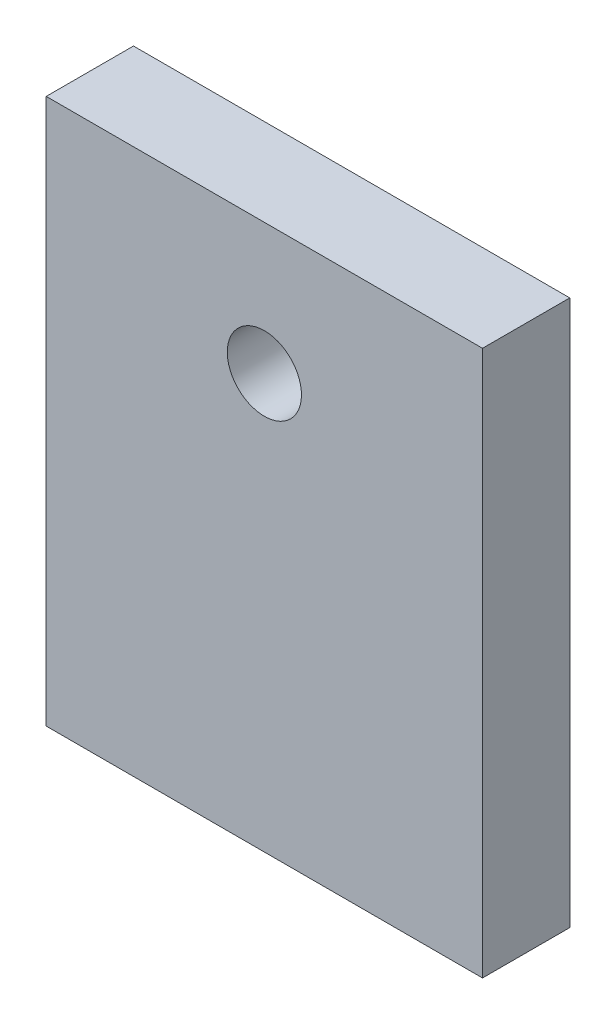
from build123d import *

# Parameters (mm, degrees)
ESQUISSE1_W        = 50
ESQUISSE1_H        = 10
EXTRUSION1_DEPTH   = 62.5
TROU_TARAUD_M101_D = 8.5


with BuildPart() as part:
    # Esquisse1 → Extrusion1 (new body)
    with BuildSketch(Plane(origin=(0, 0, 0), x_dir=(1, 0, 0), z_dir=(0, 1, 0))):
        with Locations((25, 5)):
            Rectangle(ESQUISSE1_W, ESQUISSE1_H)
    extrude(amount=EXTRUSION1_DEPTH)

    # Trou taraud_ M101 (through all)
    with Locations(Plane(origin=(0, 0, -10), x_dir=(-1, 0, 0), z_dir=(0, 0, -1))):
        with Locations((-25, 47.5)):
            Hole(TROU_TARAUD_M101_D / 2)


solid = part.part
